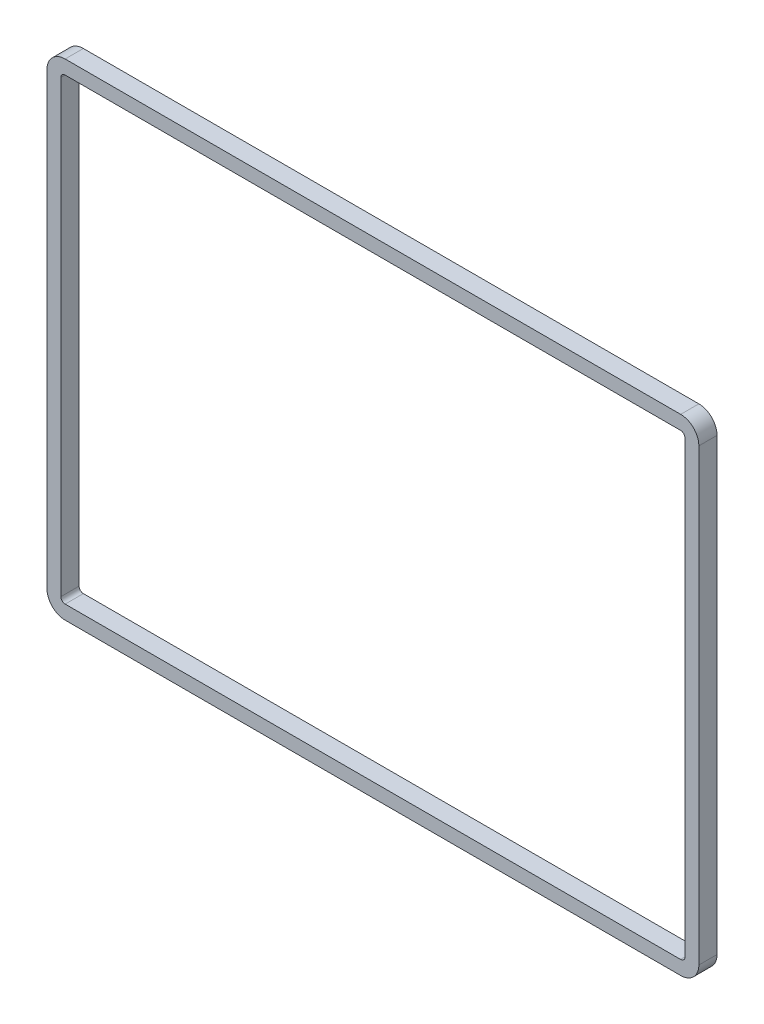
from build123d import *

# Parameters (mm, degrees)
EXTRUSION1_DEPTH = 1.7


with BuildPart() as part:
    # Esquisse1 → Extrusion1 (new body)
    with BuildSketch(Plane.XY):
        with BuildLine():
            Line((-54.092596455, -30.86527633), (3.407403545, -30.86527633))
            ThreePointArc((3.407403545, -30.86527633), (4.609485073, -30.367357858), (5.107403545, -29.16527633))
            Line((5.107403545, -29.16527633), (5.107403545, 12.83472367))
            ThreePointArc((5.107403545, 12.83472367), (4.609485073, 14.036805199), (3.407403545, 14.53472367))
            Line((3.407403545, 14.53472367), (-54.092596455, 14.53472367))
            ThreePointArc((-54.092596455, 14.53472367), (-55.294677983, 14.036805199), (-55.792596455, 12.83472367))
            Line((-55.792596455, 12.83472367), (-55.792596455, -29.16527633))
            ThreePointArc((-55.792596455, -29.16527633), (-55.294677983, -30.367357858), (-54.092596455, -30.86527633))
        make_face()
        with BuildLine():
            Line((-54.092596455, -29.56527633), (3.407403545, -29.56527633))
            ThreePointArc((3.407403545, -29.56527633), (3.690246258, -29.448119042), (3.807403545, -29.16527633))
            Line((3.807403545, -29.16527633), (3.807403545, 12.83472367))
            ThreePointArc((3.807403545, 12.83472367), (3.690246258, 13.117566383), (3.407403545, 13.23472367))
            Line((3.407403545, 13.23472367), (-54.092596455, 13.23472367))
            ThreePointArc((-54.092596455, 13.23472367), (-54.375439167, 13.117566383), (-54.492596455, 12.83472367))
            Line((-54.492596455, 12.83472367), (-54.492596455, -29.16527633))
            ThreePointArc((-54.492596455, -29.16527633), (-54.375439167, -29.448119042), (-54.092596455, -29.56527633))
        make_face(mode=Mode.SUBTRACT)
    extrude(amount=EXTRUSION1_DEPTH)


solid = part.part
